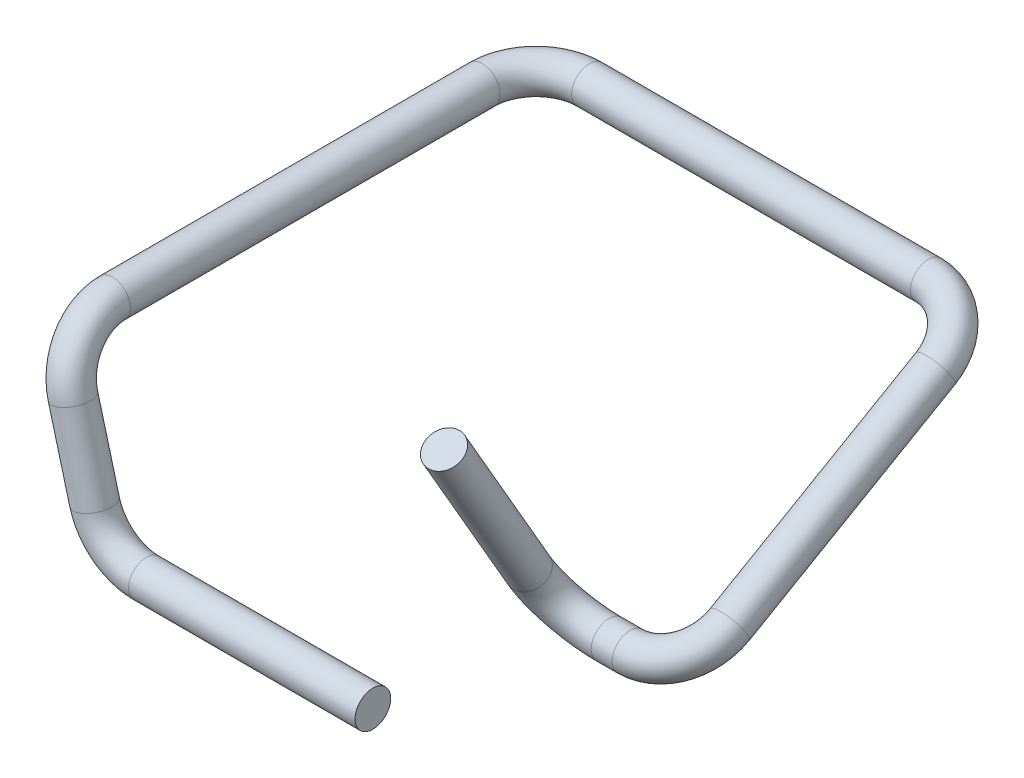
ISO-10303-21;
HEADER;
FILE_DESCRIPTION(('STEP AP214'),'2;1');
FILE_NAME('part.step','',(''),(''),'','','');
FILE_SCHEMA(('AUTOMOTIVE_DESIGN { 1 0 10303 214 1 1 1 1 }'));
ENDSEC;
DATA;
#1=APPLICATION_CONTEXT('core data for automotive mechanical design processes');
#2=APPLICATION_PROTOCOL_DEFINITION('international standard','automotive_design',2000,#1);
#3=PRODUCT_CONTEXT('',#1,'mechanical');
#4=PRODUCT('Part','Part','',(#3));
#5=PRODUCT_RELATED_PRODUCT_CATEGORY('part','',(#4));
#6=PRODUCT_DEFINITION_FORMATION('','',#4);
#7=PRODUCT_DEFINITION_CONTEXT('part definition',#1,'design');
#8=PRODUCT_DEFINITION('design','',#6,#7);
#9=PRODUCT_DEFINITION_SHAPE('','',#8);
#10=(LENGTH_UNIT() NAMED_UNIT(*) SI_UNIT(.MILLI.,.METRE.));
#11=(NAMED_UNIT(*) PLANE_ANGLE_UNIT() SI_UNIT($,.RADIAN.));
#12=(NAMED_UNIT(*) SI_UNIT($,.STERADIAN.) SOLID_ANGLE_UNIT());
#13=UNCERTAINTY_MEASURE_WITH_UNIT(LENGTH_MEASURE(1.E-05),#10,'distance_accuracy_value','');
#14=(GEOMETRIC_REPRESENTATION_CONTEXT(3) GLOBAL_UNCERTAINTY_ASSIGNED_CONTEXT((#13)) GLOBAL_UNIT_ASSIGNED_CONTEXT((#10,
#11,#12)) REPRESENTATION_CONTEXT('',''));
#15=CARTESIAN_POINT('',(0.,0.,0.));
#16=DIRECTION('',(0.,0.,1.));
#17=DIRECTION('',(1.,0.,0.));
#18=AXIS2_PLACEMENT_3D('',#15,#16,#17);
#19=CARTESIAN_POINT('',(2.39760205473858,25.9807621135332,-85.0000000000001));
#20=DIRECTION('',(0.,0.86602540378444,0.499999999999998));
#21=DIRECTION('',(0.,-0.499999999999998,0.86602540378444));
#22=AXIS2_PLACEMENT_3D('',#19,#20,#21);
#23=CYLINDRICAL_SURFACE('',#22,10.);
#24=CARTESIAN_POINT('',(2.39760205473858,25.9807621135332,-85.0000000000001));
#25=DIRECTION('',(0.,-0.866025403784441,-0.499999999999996));
#26=DIRECTION('',(-0.707106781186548,0.35355339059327,-0.612372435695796));
#27=AXIS2_PLACEMENT_3D('',#24,#25,#26);
#28=CIRCLE('',#27,10.);
#29=CARTESIAN_POINT('',(-7.60239794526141,25.9807621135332,-85.0000000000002));
#30=VERTEX_POINT('',#29);
#31=EDGE_CURVE('E32',#30,#30,#28,.T.);
#32=ORIENTED_EDGE('',*,*,#31,.F.);
#33=EDGE_LOOP('',(#32));
#34=FACE_BOUND('',#33,.T.);
#35=CARTESIAN_POINT('',(2.39760205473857,108.253175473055,-37.5000000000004));
#36=DIRECTION('',(0.,-0.866025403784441,-0.499999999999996));
#37=DIRECTION('',(-0.707106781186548,0.35355339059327,-0.612372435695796));
#38=AXIS2_PLACEMENT_3D('',#35,#36,#37);
#39=CIRCLE('',#38,10.);
#40=CARTESIAN_POINT('',(-4.67346575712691,111.788709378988,-43.6237243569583));
#41=VERTEX_POINT('',#40);
#42=EDGE_CURVE('E10',#41,#41,#39,.T.);
#43=ORIENTED_EDGE('',*,*,#42,.T.);
#44=EDGE_LOOP('',(#43));
#45=FACE_BOUND('',#44,.T.);
#46=ADVANCED_FACE('F26',(#34,#45),#23,.T.);
#47=CARTESIAN_POINT('',(32.3976020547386,25.9807621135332,-85.0000000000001));
#48=DIRECTION('',(0.,0.499999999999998,-0.86602540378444));
#49=DIRECTION('',(0.,0.86602540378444,0.499999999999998));
#50=AXIS2_PLACEMENT_3D('',#47,#48,#49);
#51=TOROIDAL_SURFACE('',#50,30.,10.);
#52=CARTESIAN_POINT('',(32.3976020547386,0.,-100.));
#53=DIRECTION('',(1.,0.,0.));
#54=DIRECTION('',(0.,-0.258819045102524,-0.965925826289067));
#55=AXIS2_PLACEMENT_3D('',#52,#53,#54);
#56=CIRCLE('',#55,10.);
#57=CARTESIAN_POINT('',(32.3976020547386,-8.66025403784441,-105.));
#58=VERTEX_POINT('',#57);
#59=EDGE_CURVE('E36',#58,#58,#56,.T.);
#60=CARTESIAN_POINT('',(32.3976020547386,25.9807621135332,-85.0000000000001));
#61=DIRECTION('',(0.,0.499999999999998,-0.86602540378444));
#62=DIRECTION('',(0.,0.86602540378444,0.499999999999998));
#63=AXIS2_PLACEMENT_3D('',#60,#61,#62);
#64=CIRCLE('',#63,40.);
#65=EDGE_CURVE('',#58,#30,#64,.T.);
#66=ORIENTED_EDGE('',*,*,#59,.F.);
#67=ORIENTED_EDGE('',*,*,#31,.T.);
#68=ORIENTED_EDGE('',*,*,#65,.T.);
#69=ORIENTED_EDGE('',*,*,#65,.F.);
#70=EDGE_LOOP('',(#66,#68,#67,#69));
#71=FACE_BOUND('',#70,.T.);
#72=ADVANCED_FACE('F94',(#71),#51,.T.);
#73=CARTESIAN_POINT('',(44.1180954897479,0.,-100.));
#74=DIRECTION('',(-1.,0.,0.));
#75=DIRECTION('',(0.,-1.,0.));
#76=AXIS2_PLACEMENT_3D('',#73,#74,#75);
#77=CYLINDRICAL_SURFACE('',#76,10.);
#78=CARTESIAN_POINT('',(44.1180954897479,0.,-100.));
#79=DIRECTION('',(1.,0.,0.));
#80=DIRECTION('',(0.,-0.258819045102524,-0.965925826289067));
#81=AXIS2_PLACEMENT_3D('',#78,#79,#80);
#82=CIRCLE('',#81,10.);
#83=CARTESIAN_POINT('',(44.1180954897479,-5.00000000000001,-91.3397459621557));
#84=VERTEX_POINT('',#83);
#85=EDGE_CURVE('E40',#84,#84,#82,.T.);
#86=ORIENTED_EDGE('',*,*,#85,.F.);
#87=EDGE_LOOP('',(#86));
#88=FACE_BOUND('',#87,.T.);
#89=ORIENTED_EDGE('',*,*,#59,.T.);
#90=EDGE_LOOP('',(#89));
#91=FACE_BOUND('',#90,.T.);
#92=ADVANCED_FACE('F99',(#88,#91),#77,.T.);
#93=CARTESIAN_POINT('',(44.1180954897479,14.9999999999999,-125.980762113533));
#94=DIRECTION('',(0.,-0.866025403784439,-0.499999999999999));
#95=DIRECTION('',(0.,0.499999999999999,-0.866025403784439));
#96=AXIS2_PLACEMENT_3D('',#93,#94,#95);
#97=TOROIDAL_SURFACE('',#96,30.,10.);
#98=CARTESIAN_POINT('',(74.1180954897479,15.,-125.980762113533));
#99=DIRECTION('',(0.,0.499999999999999,-0.866025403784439));
#100=DIRECTION('',(-0.707106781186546,-0.612372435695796,-0.353553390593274));
#101=AXIS2_PLACEMENT_3D('',#98,#99,#100);
#102=CIRCLE('',#101,10.);
#103=CARTESIAN_POINT('',(84.1180954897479,15.,-125.980762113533));
#104=VERTEX_POINT('',#103);
#105=EDGE_CURVE('E45',#104,#104,#102,.T.);
#106=CARTESIAN_POINT('',(44.1180954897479,14.9999999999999,-125.980762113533));
#107=DIRECTION('',(0.,-0.866025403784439,-0.499999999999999));
#108=DIRECTION('',(0.,0.499999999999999,-0.866025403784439));
#109=AXIS2_PLACEMENT_3D('',#106,#107,#108);
#110=CIRCLE('',#109,40.);
#111=EDGE_CURVE('',#104,#84,#110,.T.);
#112=ORIENTED_EDGE('',*,*,#105,.F.);
#113=ORIENTED_EDGE('',*,*,#85,.T.);
#114=ORIENTED_EDGE('',*,*,#111,.T.);
#115=ORIENTED_EDGE('',*,*,#111,.F.);
#116=EDGE_LOOP('',(#112,#114,#113,#115));
#117=FACE_BOUND('',#116,.T.);
#118=ADVANCED_FACE('F104',(#117),#97,.T.);
#119=CARTESIAN_POINT('',(74.1180954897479,81.5925826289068,-241.322498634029));
#120=DIRECTION('',(0.,-0.499999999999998,0.86602540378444));
#121=DIRECTION('',(0.,-0.86602540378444,-0.499999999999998));
#122=AXIS2_PLACEMENT_3D('',#119,#120,#121);
#123=CYLINDRICAL_SURFACE('',#122,10.);
#124=CARTESIAN_POINT('',(74.1180954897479,81.5925826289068,-241.322498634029));
#125=DIRECTION('',(0.,0.499999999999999,-0.866025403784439));
#126=DIRECTION('',(-0.707106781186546,-0.612372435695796,-0.353553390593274));
#127=AXIS2_PLACEMENT_3D('',#124,#125,#126);
#128=CIRCLE('',#127,10.);
#129=CARTESIAN_POINT('',(84.1180954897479,81.5925826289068,-241.322498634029));
#130=VERTEX_POINT('',#129);
#131=EDGE_CURVE('E48',#130,#130,#128,.T.);
#132=ORIENTED_EDGE('',*,*,#131,.F.);
#133=EDGE_LOOP('',(#132));
#134=FACE_BOUND('',#133,.T.);
#135=ORIENTED_EDGE('',*,*,#105,.T.);
#136=EDGE_LOOP('',(#135));
#137=FACE_BOUND('',#136,.T.);
#138=ADVANCED_FACE('F111',(#134,#137),#123,.T.);
#139=CARTESIAN_POINT('',(44.1180954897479,81.5925826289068,-241.322498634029));
#140=DIRECTION('',(0.,-0.866025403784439,-0.499999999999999));
#141=DIRECTION('',(0.,0.499999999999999,-0.866025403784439));
#142=AXIS2_PLACEMENT_3D('',#139,#140,#141);
#143=TOROIDAL_SURFACE('',#142,30.,10.);
#144=CARTESIAN_POINT('',(44.1180954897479,96.5925826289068,-267.303260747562));
#145=DIRECTION('',(-1.,0.,0.));
#146=DIRECTION('',(0.,-0.965925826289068,0.258819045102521));
#147=AXIS2_PLACEMENT_3D('',#144,#145,#146);
#148=CIRCLE('',#147,10.);
#149=CARTESIAN_POINT('',(44.1180954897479,101.592582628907,-275.963514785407));
#150=VERTEX_POINT('',#149);
#151=EDGE_CURVE('E51',#150,#150,#148,.T.);
#152=CARTESIAN_POINT('',(44.1180954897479,81.5925826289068,-241.322498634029));
#153=DIRECTION('',(0.,-0.866025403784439,-0.499999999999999));
#154=DIRECTION('',(0.,0.499999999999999,-0.866025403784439));
#155=AXIS2_PLACEMENT_3D('',#152,#153,#154);
#156=CIRCLE('',#155,40.);
#157=EDGE_CURVE('',#150,#130,#156,.T.);
#158=ORIENTED_EDGE('',*,*,#151,.F.);
#159=ORIENTED_EDGE('',*,*,#131,.T.);
#160=ORIENTED_EDGE('',*,*,#157,.T.);
#161=ORIENTED_EDGE('',*,*,#157,.F.);
#162=EDGE_LOOP('',(#158,#160,#159,#161));
#163=FACE_BOUND('',#162,.T.);
#164=ADVANCED_FACE('F115',(#163),#143,.T.);
#165=CARTESIAN_POINT('',(-145.881904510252,96.5925826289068,-267.303260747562));
#166=DIRECTION('',(1.,0.,0.));
#167=DIRECTION('',(0.,0.,-1.));
#168=AXIS2_PLACEMENT_3D('',#165,#166,#167);
#169=CYLINDRICAL_SURFACE('',#168,10.);
#170=CARTESIAN_POINT('',(-145.881904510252,96.5925826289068,-267.303260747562));
#171=DIRECTION('',(-1.,0.,0.));
#172=DIRECTION('',(0.,-0.965925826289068,0.258819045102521));
#173=AXIS2_PLACEMENT_3D('',#170,#171,#172);
#174=CIRCLE('',#173,10.);
#175=CARTESIAN_POINT('',(-145.881904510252,96.5925826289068,-277.303260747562));
#176=VERTEX_POINT('',#175);
#177=EDGE_CURVE('E54',#176,#176,#174,.T.);
#178=ORIENTED_EDGE('',*,*,#177,.F.);
#179=EDGE_LOOP('',(#178));
#180=FACE_BOUND('',#179,.T.);
#181=ORIENTED_EDGE('',*,*,#151,.T.);
#182=EDGE_LOOP('',(#181));
#183=FACE_BOUND('',#182,.T.);
#184=ADVANCED_FACE('F119',(#180,#183),#169,.T.);
#185=CARTESIAN_POINT('',(-145.881904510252,96.5925826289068,-237.303260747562));
#186=DIRECTION('',(0.,-1.,0.));
#187=DIRECTION('',(0.,0.,-1.));
#188=AXIS2_PLACEMENT_3D('',#185,#186,#187);
#189=TOROIDAL_SURFACE('',#188,30.,10.);
#190=CARTESIAN_POINT('',(-175.881904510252,96.5925826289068,-237.303260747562));
#191=DIRECTION('',(0.,0.,1.));
#192=DIRECTION('',(0.258819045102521,-0.965925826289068,0.));
#193=AXIS2_PLACEMENT_3D('',#190,#191,#192);
#194=CIRCLE('',#193,10.);
#195=CARTESIAN_POINT('',(-185.881904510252,96.5925826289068,-237.303260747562));
#196=VERTEX_POINT('',#195);
#197=EDGE_CURVE('E57',#196,#196,#194,.T.);
#198=CARTESIAN_POINT('',(-145.881904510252,96.5925826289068,-237.303260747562));
#199=DIRECTION('',(0.,-1.,0.));
#200=DIRECTION('',(0.,0.,-1.));
#201=AXIS2_PLACEMENT_3D('',#198,#199,#200);
#202=CIRCLE('',#201,40.);
#203=EDGE_CURVE('',#196,#176,#202,.T.);
#204=ORIENTED_EDGE('',*,*,#197,.F.);
#205=ORIENTED_EDGE('',*,*,#177,.T.);
#206=ORIENTED_EDGE('',*,*,#203,.T.);
#207=ORIENTED_EDGE('',*,*,#203,.F.);
#208=EDGE_LOOP('',(#204,#206,#205,#207));
#209=FACE_BOUND('',#208,.T.);
#210=ADVANCED_FACE('F123',(#209),#189,.T.);
#211=CARTESIAN_POINT('',(-175.881904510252,96.5925826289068,-30.));
#212=DIRECTION('',(0.,0.,-1.));
#213=DIRECTION('',(0.,1.,0.));
#214=AXIS2_PLACEMENT_3D('',#211,#212,#213);
#215=CYLINDRICAL_SURFACE('',#214,10.);
#216=CARTESIAN_POINT('',(-175.881904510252,96.5925826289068,-30.));
#217=DIRECTION('',(0.,0.,1.));
#218=DIRECTION('',(0.258819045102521,-0.965925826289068,0.));
#219=AXIS2_PLACEMENT_3D('',#216,#217,#218);
#220=CIRCLE('',#219,10.);
#221=CARTESIAN_POINT('',(-178.470094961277,106.251840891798,-30.));
#222=VERTEX_POINT('',#221);
#223=EDGE_CURVE('E60',#222,#222,#220,.T.);
#224=ORIENTED_EDGE('',*,*,#223,.F.);
#225=EDGE_LOOP('',(#224));
#226=FACE_BOUND('',#225,.T.);
#227=ORIENTED_EDGE('',*,*,#197,.T.);
#228=EDGE_LOOP('',(#227));
#229=FACE_BOUND('',#228,.T.);
#230=ADVANCED_FACE('F127',(#226,#229),#215,.T.);
#231=CARTESIAN_POINT('',(-168.117333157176,67.6148078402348,-30.));
#232=DIRECTION('',(-0.965925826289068,-0.258819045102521,0.));
#233=DIRECTION('',(0.258819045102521,-0.965925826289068,0.));
#234=AXIS2_PLACEMENT_3D('',#231,#232,#233);
#235=TOROIDAL_SURFACE('',#234,30.,10.);
#236=CARTESIAN_POINT('',(-168.117333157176,67.6148078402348,0.));
#237=DIRECTION('',(0.258819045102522,-0.965925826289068,0.));
#238=DIRECTION('',(0.,0.,-1.));
#239=AXIS2_PLACEMENT_3D('',#236,#237,#238);
#240=CIRCLE('',#239,10.);
#241=CARTESIAN_POINT('',(-168.117333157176,67.6148078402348,10.));
#242=VERTEX_POINT('',#241);
#243=EDGE_CURVE('E63',#242,#242,#240,.T.);
#244=CARTESIAN_POINT('',(-168.117333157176,67.6148078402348,-30.));
#245=DIRECTION('',(-0.965925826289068,-0.258819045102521,0.));
#246=DIRECTION('',(0.258819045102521,-0.965925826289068,0.));
#247=AXIS2_PLACEMENT_3D('',#244,#245,#246);
#248=CIRCLE('',#247,40.);
#249=EDGE_CURVE('',#242,#222,#248,.T.);
#250=ORIENTED_EDGE('',*,*,#243,.F.);
#251=ORIENTED_EDGE('',*,*,#223,.T.);
#252=ORIENTED_EDGE('',*,*,#249,.T.);
#253=ORIENTED_EDGE('',*,*,#249,.F.);
#254=EDGE_LOOP('',(#250,#252,#251,#253));
#255=FACE_BOUND('',#254,.T.);
#256=ADVANCED_FACE('F131',(#255),#235,.T.);
#257=CARTESIAN_POINT('',(-155.957965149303,22.2354286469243,0.));
#258=DIRECTION('',(-0.258819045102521,0.965925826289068,0.));
#259=DIRECTION('',(-0.965925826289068,-0.258819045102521,0.));
#260=AXIS2_PLACEMENT_3D('',#257,#258,#259);
#261=CYLINDRICAL_SURFACE('',#260,10.);
#262=CARTESIAN_POINT('',(-155.957965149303,22.2354286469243,0.));
#263=DIRECTION('',(0.258819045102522,-0.965925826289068,0.));
#264=DIRECTION('',(0.,0.,-1.));
#265=AXIS2_PLACEMENT_3D('',#262,#263,#264);
#266=CIRCLE('',#265,10.);
#267=CARTESIAN_POINT('',(-165.617223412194,19.6472381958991,0.));
#268=VERTEX_POINT('',#267);
#269=EDGE_CURVE('E66',#268,#268,#266,.T.);
#270=ORIENTED_EDGE('',*,*,#269,.F.);
#271=EDGE_LOOP('',(#270));
#272=FACE_BOUND('',#271,.T.);
#273=ORIENTED_EDGE('',*,*,#243,.T.);
#274=EDGE_LOOP('',(#273));
#275=FACE_BOUND('',#274,.T.);
#276=ADVANCED_FACE('F90',(#272,#275),#261,.T.);
#277=CARTESIAN_POINT('',(-126.980190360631,30.,0.));
#278=DIRECTION('',(0.,0.,-1.));
#279=DIRECTION('',(-1.,0.,0.));
#280=AXIS2_PLACEMENT_3D('',#277,#278,#279);
#281=TOROIDAL_SURFACE('',#280,30.,10.);
#282=CARTESIAN_POINT('',(-126.980190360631,0.,0.));
#283=DIRECTION('',(1.,0.,0.));
#284=DIRECTION('',(0.,0.,-1.));
#285=AXIS2_PLACEMENT_3D('',#282,#283,#284);
#286=CIRCLE('',#285,10.);
#287=CARTESIAN_POINT('',(-126.980190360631,-10.,0.));
#288=VERTEX_POINT('',#287);
#289=EDGE_CURVE('E69',#288,#288,#286,.T.);
#290=CARTESIAN_POINT('',(-126.980190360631,30.,0.));
#291=DIRECTION('',(0.,0.,-1.));
#292=DIRECTION('',(-1.,0.,0.));
#293=AXIS2_PLACEMENT_3D('',#290,#291,#292);
#294=CIRCLE('',#293,40.);
#295=EDGE_CURVE('',#288,#268,#294,.T.);
#296=ORIENTED_EDGE('',*,*,#289,.F.);
#297=ORIENTED_EDGE('',*,*,#269,.T.);
#298=ORIENTED_EDGE('',*,*,#295,.T.);
#299=ORIENTED_EDGE('',*,*,#295,.F.);
#300=EDGE_LOOP('',(#296,#298,#297,#299));
#301=FACE_BOUND('',#300,.T.);
#302=ADVANCED_FACE('F81',(#301),#281,.T.);
#303=CARTESIAN_POINT('',(-126.980190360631,0.,0.));
#304=DIRECTION('',(1.,0.,0.));
#305=DIRECTION('',(0.,1.,0.));
#306=AXIS2_PLACEMENT_3D('',#303,#304,#305);
#307=CYLINDRICAL_SURFACE('',#306,10.);
#308=ORIENTED_EDGE('',*,*,#289,.T.);
#309=EDGE_LOOP('',(#308));
#310=FACE_BOUND('',#309,.T.);
#311=CARTESIAN_POINT('',(0.,0.,0.));
#312=DIRECTION('',(1.,0.,0.));
#313=DIRECTION('',(0.,0.,-1.));
#314=AXIS2_PLACEMENT_3D('',#311,#312,#313);
#315=CIRCLE('',#314,10.);
#316=CARTESIAN_POINT('',(0.,0.,-10.));
#317=VERTEX_POINT('',#316);
#318=EDGE_CURVE('E72',#317,#317,#315,.T.);
#319=ORIENTED_EDGE('',*,*,#318,.F.);
#320=EDGE_LOOP('',(#319));
#321=FACE_BOUND('',#320,.T.);
#322=ADVANCED_FACE('F78',(#310,#321),#307,.T.);
#323=CARTESIAN_POINT('',(2.39760205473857,108.253175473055,-37.5000000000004));
#324=DIRECTION('',(0.,-0.866025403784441,-0.499999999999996));
#325=DIRECTION('',(-0.707106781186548,0.35355339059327,-0.612372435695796));
#326=AXIS2_PLACEMENT_3D('',#323,#324,#325);
#327=PLANE('',#326);
#328=ORIENTED_EDGE('',*,*,#42,.F.);
#329=EDGE_LOOP('',(#328));
#330=FACE_BOUND('',#329,.T.);
#331=ADVANCED_FACE('F80',(#330),#327,.F.);
#332=CARTESIAN_POINT('',(0.,0.,0.));
#333=DIRECTION('',(1.,0.,0.));
#334=DIRECTION('',(0.,0.,-1.));
#335=AXIS2_PLACEMENT_3D('',#332,#333,#334);
#336=PLANE('',#335);
#337=ORIENTED_EDGE('',*,*,#318,.T.);
#338=EDGE_LOOP('',(#337));
#339=FACE_BOUND('',#338,.T.);
#340=ADVANCED_FACE('F76',(#339),#336,.T.);
#341=CLOSED_SHELL('',(#46,#72,#92,#118,#138,#164,#184,#210,#230,#256,#276,#302,#322,#331,#340));
#342=MANIFOLD_SOLID_BREP('B2',#341);
#343=ADVANCED_BREP_SHAPE_REPRESENTATION('',(#18,#342),#14);
#344=SHAPE_DEFINITION_REPRESENTATION(#9,#343);
ENDSEC;
END-ISO-10303-21;
